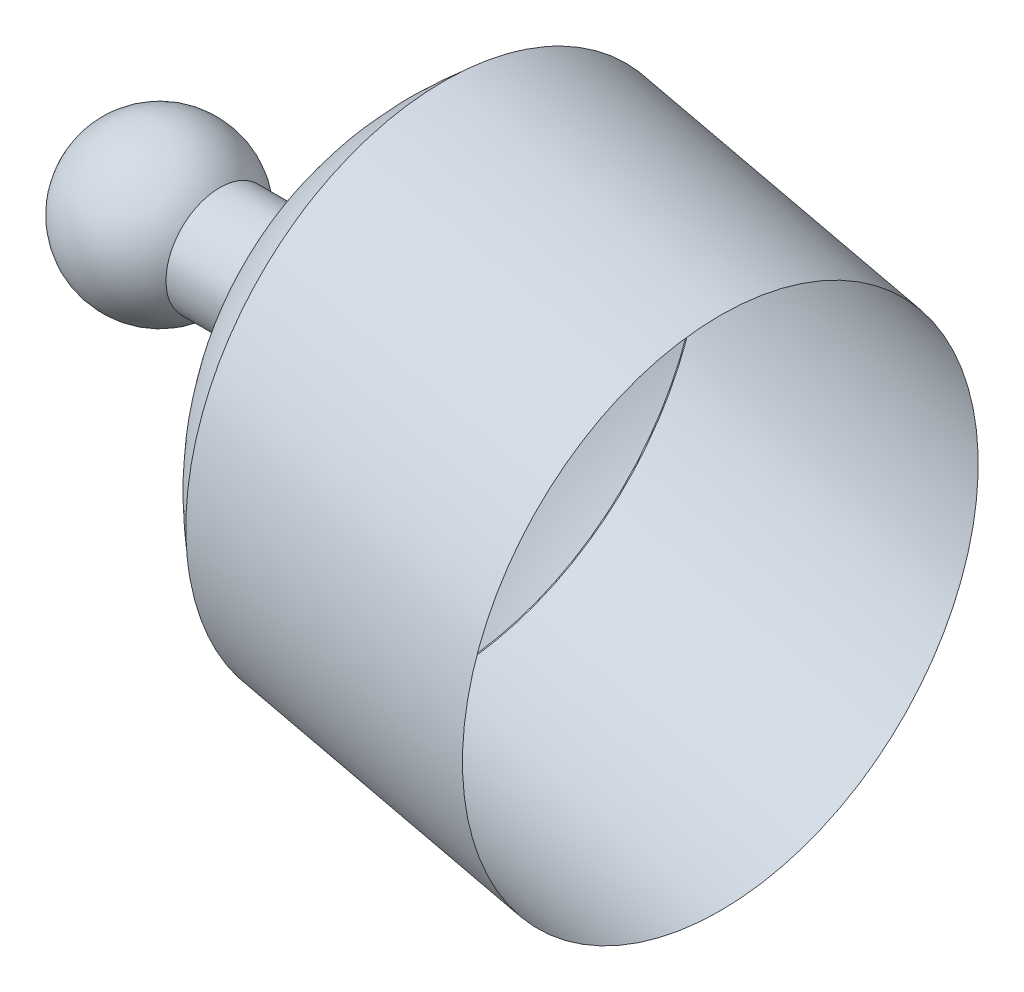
from build123d import *


with BuildPart() as part:
    # Esquisse1 → R_volution2 (revolve)
    with BuildSketch(Plane.XY):
        with BuildLine():
            Line((0.284931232, 0.5), (1.284931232, 0.5))
            Line((1.284931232, 0.5), (1.284931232, 0))
            Line((1.284931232, 0), (-1.024085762, 0))
            ThreePointArc((-1.024085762, 0), (-0.541702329, 0.700629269), (0.284931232, 0.5))
        make_face()
    revolve(axis=Axis((-0.581094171, 0, 0), (1, 0, 0)))


solid = part.part
